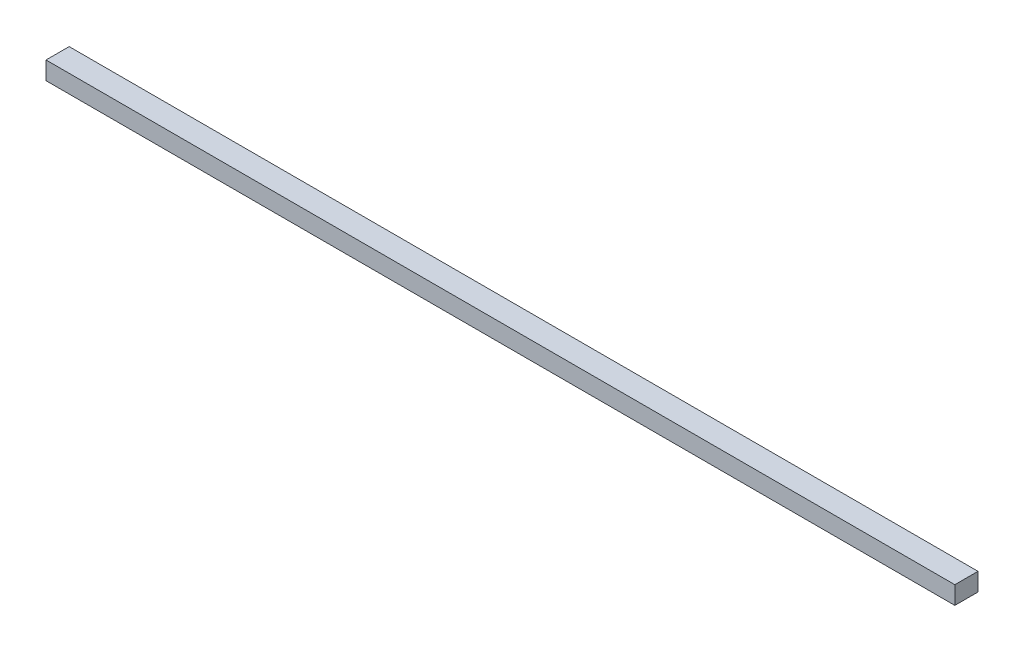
from build123d import *

# Parameters (mm, degrees)
SKETCH1_W           = 642.9375
SKETCH1_H           = 16.383
BOSS_EXTRUDE1_DEPTH = 12.7


with BuildPart() as part:
    # Sketch1 → Boss-Extrude1 (new body)
    with BuildSketch(Plane(origin=(0, 0, 0), x_dir=(1, 0, 0), z_dir=(0, 1, 0))):
        Rectangle(SKETCH1_W, SKETCH1_H)
    extrude(amount=BOSS_EXTRUDE1_DEPTH)


solid = part.part
